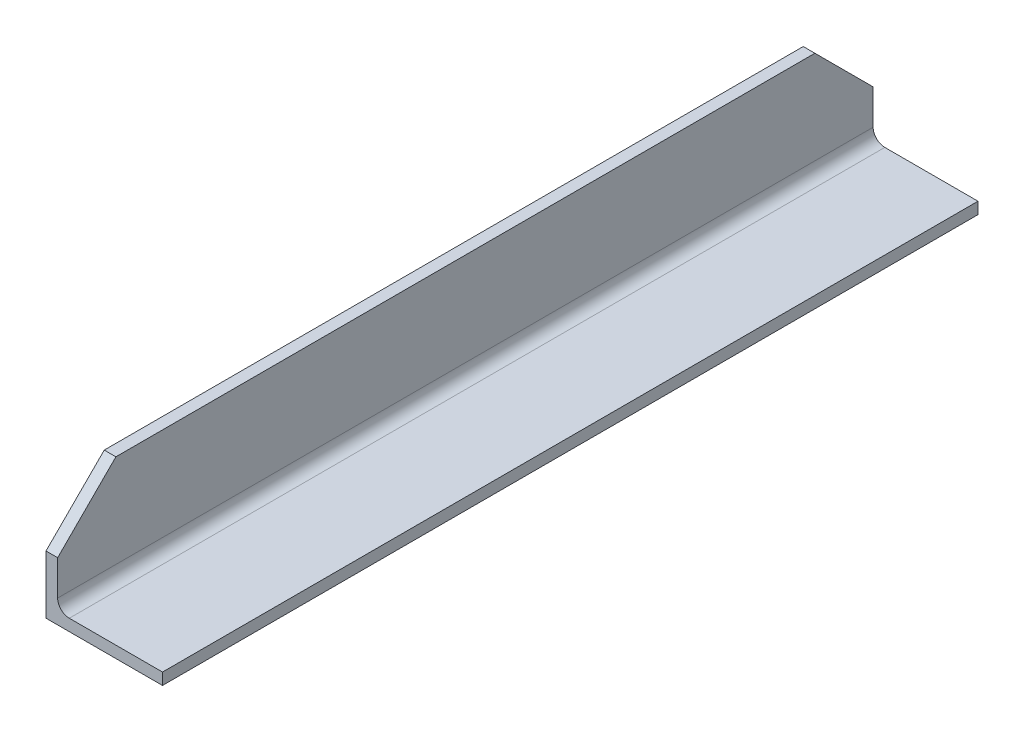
from build123d import *

# Parameters (mm, degrees)
BOSS_EXTRUDE1_DEPTH = 700
CHAMFER1_SIZE       = 50


with BuildPart() as part:
    # Sketch1 → Boss-Extrude1 (new body)
    with BuildSketch(Plane.XY):
        with BuildLine():
            Line((0, 100), (0, 0))
            Line((0, 0), (100, 0))
            Line((100, 0), (100, 10))
            Line((100, 10), (20, 10))
            ThreePointArc((20, 10), (12.928932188, 12.928932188), (10, 20))
            Line((10, 20), (10, 100))
            Line((10, 100), (0, 100))
        make_face()
    extrude(amount=BOSS_EXTRUDE1_DEPTH)

    # Chamfer1
    chamfer1_edges = [part.edges().sort_by_distance(p)[0] for p in [
        (5, 100, 700),
        (5, 100, 0),
    ]]
    chamfer(chamfer1_edges, length=CHAMFER1_SIZE)


solid = part.part
